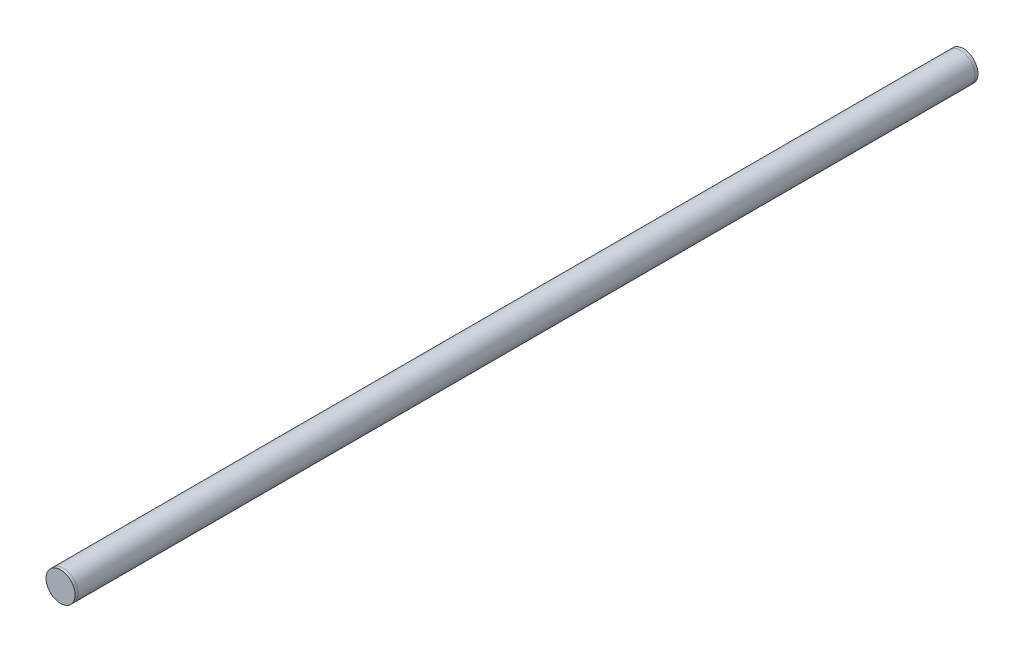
from build123d import *

# Parameters (mm, degrees)
SKETCH1_R           = 12.7
BOSS_EXTRUDE1_DEPTH = 787.4


with BuildPart() as part:
    # Sketch1 → Boss-Extrude1 (new body)
    with BuildSketch(Plane.XY):
        Circle(SKETCH1_R)
    extrude(amount=BOSS_EXTRUDE1_DEPTH)


solid = part.part
